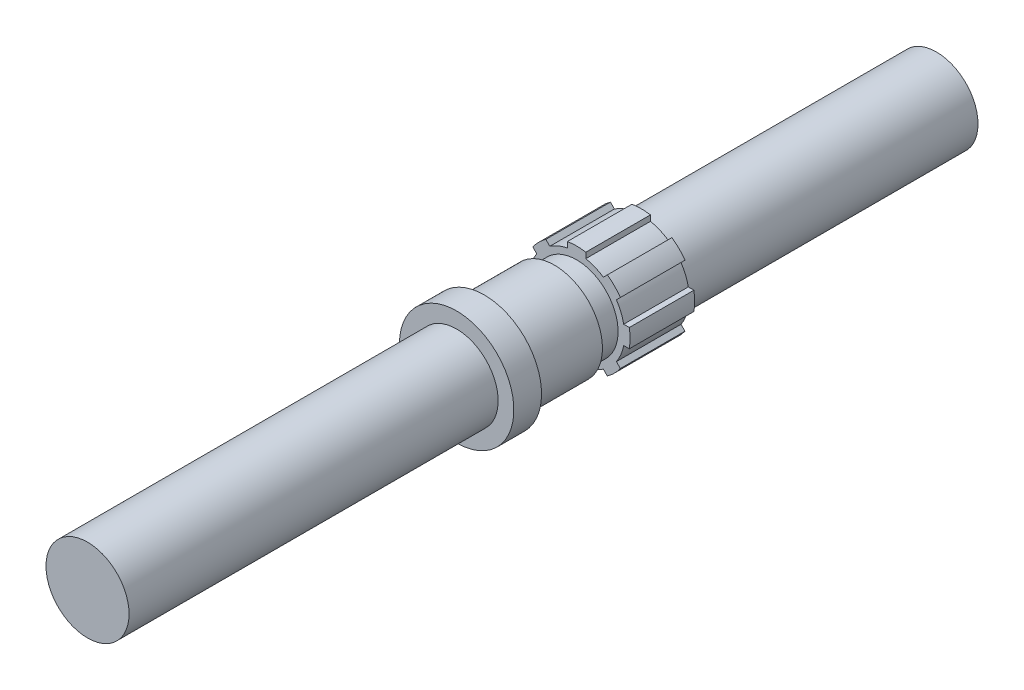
ISO-10303-21;
HEADER;
FILE_DESCRIPTION(('STEP AP214'),'2;1');
FILE_NAME('part.step','',(''),(''),'','','');
FILE_SCHEMA(('AUTOMOTIVE_DESIGN { 1 0 10303 214 1 1 1 1 }'));
ENDSEC;
DATA;
#1=APPLICATION_CONTEXT('core data for automotive mechanical design processes');
#2=APPLICATION_PROTOCOL_DEFINITION('international standard','automotive_design',2000,#1);
#3=PRODUCT_CONTEXT('',#1,'mechanical');
#4=PRODUCT('Part','Part','',(#3));
#5=PRODUCT_RELATED_PRODUCT_CATEGORY('part','',(#4));
#6=PRODUCT_DEFINITION_FORMATION('','',#4);
#7=PRODUCT_DEFINITION_CONTEXT('part definition',#1,'design');
#8=PRODUCT_DEFINITION('design','',#6,#7);
#9=PRODUCT_DEFINITION_SHAPE('','',#8);
#10=(LENGTH_UNIT() NAMED_UNIT(*) SI_UNIT(.MILLI.,.METRE.));
#11=(NAMED_UNIT(*) PLANE_ANGLE_UNIT() SI_UNIT($,.RADIAN.));
#12=(NAMED_UNIT(*) SI_UNIT($,.STERADIAN.) SOLID_ANGLE_UNIT());
#13=UNCERTAINTY_MEASURE_WITH_UNIT(LENGTH_MEASURE(1.E-05),#10,'distance_accuracy_value','');
#14=(GEOMETRIC_REPRESENTATION_CONTEXT(3) GLOBAL_UNCERTAINTY_ASSIGNED_CONTEXT((#13)) GLOBAL_UNIT_ASSIGNED_CONTEXT((#10,
#11,#12)) REPRESENTATION_CONTEXT('',''));
#15=CARTESIAN_POINT('',(0.,0.,0.));
#16=DIRECTION('',(0.,0.,1.));
#17=DIRECTION('',(1.,0.,0.));
#18=AXIS2_PLACEMENT_3D('',#15,#16,#17);
#19=CARTESIAN_POINT('',(0.,0.,245.));
#20=DIRECTION('',(0.,0.,-1.));
#21=DIRECTION('',(-1.,0.,0.));
#22=AXIS2_PLACEMENT_3D('',#19,#20,#21);
#23=CYLINDRICAL_SURFACE('',#22,26.);
#24=CARTESIAN_POINT('',(0.,0.,207.));
#25=DIRECTION('',(0.,0.,-1.));
#26=DIRECTION('',(-1.,0.,0.));
#27=AXIS2_PLACEMENT_3D('',#24,#25,#26);
#28=CIRCLE('',#27,26.);
#29=CARTESIAN_POINT('',(-26.,0.,207.));
#30=VERTEX_POINT('',#29);
#31=EDGE_CURVE('E609',#30,#30,#28,.T.);
#32=ORIENTED_EDGE('',*,*,#31,.F.);
#33=EDGE_LOOP('',(#32));
#34=FACE_BOUND('',#33,.T.);
#35=CARTESIAN_POINT('',(0.,0.,245.));
#36=DIRECTION('',(0.,0.,-1.));
#37=DIRECTION('',(-1.,0.,0.));
#38=AXIS2_PLACEMENT_3D('',#35,#36,#37);
#39=CIRCLE('',#38,26.);
#40=CARTESIAN_POINT('',(-26.,0.,245.));
#41=VERTEX_POINT('',#40);
#42=EDGE_CURVE('E621',#41,#41,#39,.F.);
#43=ORIENTED_EDGE('',*,*,#42,.F.);
#44=EDGE_LOOP('',(#43));
#45=FACE_BOUND('',#44,.T.);
#46=ADVANCED_FACE('F27',(#34,#45),#23,.T.);
#47=CARTESIAN_POINT('',(0.,0.,260.));
#48=DIRECTION('',(0.,0.,-1.));
#49=DIRECTION('',(-1.,0.,0.));
#50=AXIS2_PLACEMENT_3D('',#47,#48,#49);
#51=PLANE('',#50);
#52=CARTESIAN_POINT('',(0.,0.,260.));
#53=DIRECTION('',(0.,0.,-1.));
#54=DIRECTION('',(-1.,0.,0.));
#55=AXIS2_PLACEMENT_3D('',#52,#53,#54);
#56=CIRCLE('',#55,31.);
#57=CARTESIAN_POINT('',(-31.,0.,260.));
#58=VERTEX_POINT('',#57);
#59=EDGE_CURVE('E618',#58,#58,#56,.T.);
#60=ORIENTED_EDGE('',*,*,#59,.F.);
#61=EDGE_LOOP('',(#60));
#62=FACE_BOUND('',#61,.T.);
#63=CARTESIAN_POINT('',(0.,0.,260.));
#64=DIRECTION('',(0.,0.,-1.));
#65=DIRECTION('',(-1.,0.,0.));
#66=AXIS2_PLACEMENT_3D('',#63,#64,#65);
#67=CIRCLE('',#66,22.5);
#68=CARTESIAN_POINT('',(-22.5,0.,260.));
#69=VERTEX_POINT('',#68);
#70=EDGE_CURVE('E11',#69,#69,#67,.T.);
#71=ORIENTED_EDGE('',*,*,#70,.T.);
#72=EDGE_LOOP('',(#71));
#73=FACE_BOUND('',#72,.T.);
#74=ADVANCED_FACE('F469',(#62,#73),#51,.F.);
#75=CARTESIAN_POINT('',(0.,0.,260.));
#76=DIRECTION('',(0.,0.,-1.));
#77=DIRECTION('',(-1.,0.,0.));
#78=AXIS2_PLACEMENT_3D('',#75,#76,#77);
#79=CYLINDRICAL_SURFACE('',#78,31.);
#80=ORIENTED_EDGE('',*,*,#59,.T.);
#81=EDGE_LOOP('',(#80));
#82=FACE_BOUND('',#81,.T.);
#83=CARTESIAN_POINT('',(0.,0.,245.));
#84=DIRECTION('',(0.,0.,-1.));
#85=DIRECTION('',(-1.,0.,0.));
#86=AXIS2_PLACEMENT_3D('',#83,#84,#85);
#87=CIRCLE('',#86,31.);
#88=CARTESIAN_POINT('',(-31.,0.,245.));
#89=VERTEX_POINT('',#88);
#90=EDGE_CURVE('E615',#89,#89,#87,.T.);
#91=ORIENTED_EDGE('',*,*,#90,.F.);
#92=EDGE_LOOP('',(#91));
#93=FACE_BOUND('',#92,.T.);
#94=ADVANCED_FACE('F477',(#82,#93),#79,.T.);
#95=CARTESIAN_POINT('',(0.,0.,245.));
#96=DIRECTION('',(0.,0.,-1.));
#97=DIRECTION('',(-1.,0.,0.));
#98=AXIS2_PLACEMENT_3D('',#95,#96,#97);
#99=PLANE('',#98);
#100=ORIENTED_EDGE('',*,*,#42,.T.);
#101=EDGE_LOOP('',(#100));
#102=FACE_BOUND('',#101,.T.);
#103=ORIENTED_EDGE('',*,*,#90,.T.);
#104=EDGE_LOOP('',(#103));
#105=FACE_BOUND('',#104,.T.);
#106=ADVANCED_FACE('F669',(#102,#105),#99,.T.);
#107=CARTESIAN_POINT('',(0.,0.,460.));
#108=DIRECTION('',(0.,0.,1.));
#109=DIRECTION('',(1.,0.,0.));
#110=AXIS2_PLACEMENT_3D('',#107,#108,#109);
#111=PLANE('',#110);
#112=CARTESIAN_POINT('',(0.,0.,460.));
#113=DIRECTION('',(0.,0.,1.));
#114=DIRECTION('',(1.,0.,0.));
#115=AXIS2_PLACEMENT_3D('',#112,#113,#114);
#116=CIRCLE('',#115,22.5);
#117=CARTESIAN_POINT('',(22.5,0.,460.));
#118=VERTEX_POINT('',#117);
#119=EDGE_CURVE('E35',#118,#118,#116,.T.);
#120=ORIENTED_EDGE('',*,*,#119,.T.);
#121=EDGE_LOOP('',(#120));
#122=FACE_BOUND('',#121,.T.);
#123=ADVANCED_FACE('F665',(#122),#111,.T.);
#124=CARTESIAN_POINT('',(0.,0.,460.));
#125=DIRECTION('',(0.,0.,-1.));
#126=DIRECTION('',(-1.,0.,0.));
#127=AXIS2_PLACEMENT_3D('',#124,#125,#126);
#128=CYLINDRICAL_SURFACE('',#127,22.5);
#129=ORIENTED_EDGE('',*,*,#119,.F.);
#130=EDGE_LOOP('',(#129));
#131=FACE_BOUND('',#130,.T.);
#132=ORIENTED_EDGE('',*,*,#70,.F.);
#133=EDGE_LOOP('',(#132));
#134=FACE_BOUND('',#133,.T.);
#135=ADVANCED_FACE('F466',(#131,#134),#128,.T.);
#136=CARTESIAN_POINT('',(0.,26.,207.));
#137=DIRECTION('',(0.,0.,1.));
#138=DIRECTION('',(1.,0.,0.));
#139=AXIS2_PLACEMENT_3D('',#136,#137,#138);
#140=PLANE('',#139);
#141=CARTESIAN_POINT('',(0.,0.,207.));
#142=DIRECTION('',(0.,0.,-1.));
#143=DIRECTION('',(-1.,0.,0.));
#144=AXIS2_PLACEMENT_3D('',#141,#142,#143);
#145=CIRCLE('',#144,22.5);
#146=CARTESIAN_POINT('',(-22.5,0.,207.));
#147=VERTEX_POINT('',#146);
#148=EDGE_CURVE('E612',#147,#147,#145,.T.);
#149=ORIENTED_EDGE('',*,*,#148,.F.);
#150=EDGE_LOOP('',(#149));
#151=FACE_BOUND('',#150,.T.);
#152=ORIENTED_EDGE('',*,*,#31,.T.);
#153=EDGE_LOOP('',(#152));
#154=FACE_BOUND('',#153,.T.);
#155=ADVANCED_FACE('F656',(#151,#154),#140,.F.);
#156=CARTESIAN_POINT('',(0.,0.,0.));
#157=DIRECTION('',(0.,0.,-1.));
#158=DIRECTION('',(-1.,0.,0.));
#159=AXIS2_PLACEMENT_3D('',#156,#157,#158);
#160=CYLINDRICAL_SURFACE('',#159,22.5);
#161=CARTESIAN_POINT('',(0.,0.,195.));
#162=DIRECTION('',(0.,0.,-1.));
#163=DIRECTION('',(-1.,0.,0.));
#164=AXIS2_PLACEMENT_3D('',#161,#162,#163);
#165=CIRCLE('',#164,22.5);
#166=CARTESIAN_POINT('',(-22.5,0.,195.));
#167=VERTEX_POINT('',#166);
#168=EDGE_CURVE('E252',#167,#167,#165,.T.);
#169=ORIENTED_EDGE('',*,*,#168,.F.);
#170=EDGE_LOOP('',(#169));
#171=FACE_BOUND('',#170,.T.);
#172=ORIENTED_EDGE('',*,*,#148,.T.);
#173=EDGE_LOOP('',(#172));
#174=FACE_BOUND('',#173,.T.);
#175=ADVANCED_FACE('F657',(#171,#174),#160,.T.);
#176=CARTESIAN_POINT('',(0.,0.,0.));
#177=DIRECTION('',(0.,0.,1.));
#178=DIRECTION('',(1.,0.,0.));
#179=AXIS2_PLACEMENT_3D('',#176,#177,#178);
#180=PLANE('',#179);
#181=CARTESIAN_POINT('',(0.,0.,0.));
#182=DIRECTION('',(0.,0.,1.));
#183=DIRECTION('',(1.,0.,0.));
#184=AXIS2_PLACEMENT_3D('',#181,#182,#183);
#185=CIRCLE('',#184,22.5);
#186=CARTESIAN_POINT('',(22.5,0.,0.));
#187=VERTEX_POINT('',#186);
#188=EDGE_CURVE('E443',#187,#187,#185,.T.);
#189=ORIENTED_EDGE('',*,*,#188,.F.);
#190=EDGE_LOOP('',(#189));
#191=FACE_BOUND('',#190,.T.);
#192=ADVANCED_FACE('F465',(#191),#180,.F.);
#193=CARTESIAN_POINT('',(0.,0.,160.));
#194=DIRECTION('',(0.,0.,-1.));
#195=DIRECTION('',(-1.,0.,0.));
#196=AXIS2_PLACEMENT_3D('',#193,#194,#195);
#197=CIRCLE('',#196,22.5);
#198=CARTESIAN_POINT('',(-22.5,0.,160.));
#199=VERTEX_POINT('',#198);
#200=EDGE_CURVE('E441',#199,#199,#197,.T.);
#201=ORIENTED_EDGE('',*,*,#200,.T.);
#202=EDGE_LOOP('',(#201));
#203=FACE_BOUND('',#202,.T.);
#204=ORIENTED_EDGE('',*,*,#188,.T.);
#205=EDGE_LOOP('',(#204));
#206=FACE_BOUND('',#205,.T.);
#207=ADVANCED_FACE('F29',(#203,#206),#128,.T.);
#208=CARTESIAN_POINT('',(0.,0.,160.));
#209=DIRECTION('',(0.,0.,-1.));
#210=DIRECTION('',(-1.,0.,0.));
#211=AXIS2_PLACEMENT_3D('',#208,#209,#210);
#212=PLANE('',#211);
#213=CARTESIAN_POINT('',(0.,0.,160.));
#214=DIRECTION('',(0.,0.,-1.));
#215=DIRECTION('',(-1.,0.,0.));
#216=AXIS2_PLACEMENT_3D('',#213,#214,#215);
#217=CIRCLE('',#216,26.);
#218=CARTESIAN_POINT('',(5.,25.5147016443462,160.));
#219=VERTEX_POINT('',#218);
#220=CARTESIAN_POINT('',(14.506084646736,21.5771524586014,160.));
#221=VERTEX_POINT('',#220);
#222=EDGE_CURVE('E438',#219,#221,#217,.T.);
#223=ORIENTED_EDGE('',*,*,#222,.T.);
#224=DIRECTION('',(0.707106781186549,0.707106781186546,0.));
#225=VECTOR('',#224,1.);
#226=CARTESIAN_POINT('',(14.506084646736,21.5771524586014,160.));
#227=LINE('',#226,#225);
#228=CARTESIAN_POINT('',(16.6634759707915,23.7345437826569,160.));
#229=VERTEX_POINT('',#228);
#230=EDGE_CURVE('E377',#221,#229,#227,.T.);
#231=ORIENTED_EDGE('',*,*,#230,.T.);
#232=CARTESIAN_POINT('',(0.,0.,160.));
#233=DIRECTION('',(0.,0.,-1.));
#234=DIRECTION('',(-0.707106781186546,0.707106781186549,0.));
#235=AXIS2_PLACEMENT_3D('',#232,#233,#234);
#236=CIRCLE('',#235,29.);
#237=CARTESIAN_POINT('',(23.7345437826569,16.6634759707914,160.));
#238=VERTEX_POINT('',#237);
#239=EDGE_CURVE('E386',#229,#238,#236,.T.);
#240=ORIENTED_EDGE('',*,*,#239,.T.);
#241=DIRECTION('',(-0.707106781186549,-0.707106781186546,0.));
#242=VECTOR('',#241,1.);
#243=CARTESIAN_POINT('',(21.5771524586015,14.5060846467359,160.));
#244=LINE('',#243,#242);
#245=CARTESIAN_POINT('',(21.5771524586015,14.5060846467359,160.));
#246=VERTEX_POINT('',#245);
#247=EDGE_CURVE('E389',#238,#246,#244,.T.);
#248=ORIENTED_EDGE('',*,*,#247,.T.);
#249=CARTESIAN_POINT('',(25.5147016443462,4.99999999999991,160.));
#250=VERTEX_POINT('',#249);
#251=EDGE_CURVE('E442',#246,#250,#217,.T.);
#252=ORIENTED_EDGE('',*,*,#251,.T.);
#253=DIRECTION('',(1.,0.,0.));
#254=VECTOR('',#253,1.);
#255=CARTESIAN_POINT('',(25.5147016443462,4.99999999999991,160.));
#256=LINE('',#255,#254);
#257=CARTESIAN_POINT('',(28.5657137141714,4.9999999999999,160.));
#258=VERTEX_POINT('',#257);
#259=EDGE_CURVE('E350',#250,#258,#256,.T.);
#260=ORIENTED_EDGE('',*,*,#259,.T.);
#261=CARTESIAN_POINT('',(0.,0.,160.));
#262=DIRECTION('',(0.,0.,-1.));
#263=DIRECTION('',(0.,1.,0.));
#264=AXIS2_PLACEMENT_3D('',#261,#262,#263);
#265=CIRCLE('',#264,29.);
#266=CARTESIAN_POINT('',(28.5657137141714,-5.0000000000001,160.));
#267=VERTEX_POINT('',#266);
#268=EDGE_CURVE('E359',#258,#267,#265,.T.);
#269=ORIENTED_EDGE('',*,*,#268,.T.);
#270=DIRECTION('',(-1.,0.,0.));
#271=VECTOR('',#270,1.);
#272=CARTESIAN_POINT('',(25.5147016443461,-5.00000000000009,160.));
#273=LINE('',#272,#271);
#274=CARTESIAN_POINT('',(25.5147016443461,-5.00000000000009,160.));
#275=VERTEX_POINT('',#274);
#276=EDGE_CURVE('E362',#267,#275,#273,.T.);
#277=ORIENTED_EDGE('',*,*,#276,.T.);
#278=CARTESIAN_POINT('',(21.5771524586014,-14.5060846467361,160.));
#279=VERTEX_POINT('',#278);
#280=EDGE_CURVE('E592',#275,#279,#217,.T.);
#281=ORIENTED_EDGE('',*,*,#280,.T.);
#282=DIRECTION('',(0.707106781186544,-0.707106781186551,0.));
#283=VECTOR('',#282,1.);
#284=CARTESIAN_POINT('',(21.5771524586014,-14.5060846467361,160.));
#285=LINE('',#284,#283);
#286=CARTESIAN_POINT('',(23.7345437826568,-16.6634759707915,160.));
#287=VERTEX_POINT('',#286);
#288=EDGE_CURVE('E323',#279,#287,#285,.T.);
#289=ORIENTED_EDGE('',*,*,#288,.T.);
#290=CARTESIAN_POINT('',(0.,0.,160.));
#291=DIRECTION('',(0.,0.,-1.));
#292=DIRECTION('',(0.707106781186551,0.707106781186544,0.));
#293=AXIS2_PLACEMENT_3D('',#290,#291,#292);
#294=CIRCLE('',#293,29.);
#295=CARTESIAN_POINT('',(16.6634759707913,-23.734543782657,160.));
#296=VERTEX_POINT('',#295);
#297=EDGE_CURVE('E332',#287,#296,#294,.T.);
#298=ORIENTED_EDGE('',*,*,#297,.T.);
#299=DIRECTION('',(-0.707106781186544,0.707106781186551,0.));
#300=VECTOR('',#299,1.);
#301=CARTESIAN_POINT('',(14.5060846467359,-21.5771524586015,160.));
#302=LINE('',#301,#300);
#303=CARTESIAN_POINT('',(14.5060846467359,-21.5771524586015,160.));
#304=VERTEX_POINT('',#303);
#305=EDGE_CURVE('E335',#296,#304,#302,.T.);
#306=ORIENTED_EDGE('',*,*,#305,.T.);
#307=CARTESIAN_POINT('',(4.99999999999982,-25.5147016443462,160.));
#308=VERTEX_POINT('',#307);
#309=EDGE_CURVE('E589',#304,#308,#217,.T.);
#310=ORIENTED_EDGE('',*,*,#309,.T.);
#311=DIRECTION('',(0.,-1.,0.));
#312=VECTOR('',#311,1.);
#313=CARTESIAN_POINT('',(4.99999999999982,-25.5147016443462,160.));
#314=LINE('',#313,#312);
#315=CARTESIAN_POINT('',(4.9999999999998,-28.5657137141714,160.));
#316=VERTEX_POINT('',#315);
#317=EDGE_CURVE('E296',#308,#316,#314,.T.);
#318=ORIENTED_EDGE('',*,*,#317,.T.);
#319=CARTESIAN_POINT('',(0.,0.,160.));
#320=DIRECTION('',(0.,0.,-1.));
#321=DIRECTION('',(1.,0.,0.));
#322=AXIS2_PLACEMENT_3D('',#319,#320,#321);
#323=CIRCLE('',#322,29.);
#324=CARTESIAN_POINT('',(-5.0000000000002,-28.5657137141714,160.));
#325=VERTEX_POINT('',#324);
#326=EDGE_CURVE('E305',#316,#325,#323,.T.);
#327=ORIENTED_EDGE('',*,*,#326,.T.);
#328=DIRECTION('',(0.,1.,0.));
#329=VECTOR('',#328,1.);
#330=CARTESIAN_POINT('',(-5.00000000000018,-25.5147016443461,160.));
#331=LINE('',#330,#329);
#332=CARTESIAN_POINT('',(-5.00000000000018,-25.5147016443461,160.));
#333=VERTEX_POINT('',#332);
#334=EDGE_CURVE('E308',#325,#333,#331,.T.);
#335=ORIENTED_EDGE('',*,*,#334,.T.);
#336=CARTESIAN_POINT('',(-14.5060846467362,-21.5771524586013,160.));
#337=VERTEX_POINT('',#336);
#338=EDGE_CURVE('E587',#333,#337,#217,.T.);
#339=ORIENTED_EDGE('',*,*,#338,.T.);
#340=DIRECTION('',(-0.707106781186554,-0.707106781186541,0.));
#341=VECTOR('',#340,1.);
#342=CARTESIAN_POINT('',(-14.5060846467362,-21.5771524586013,160.));
#343=LINE('',#342,#341);
#344=CARTESIAN_POINT('',(-16.6634759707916,-23.7345437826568,160.));
#345=VERTEX_POINT('',#344);
#346=EDGE_CURVE('E267',#337,#345,#343,.T.);
#347=ORIENTED_EDGE('',*,*,#346,.T.);
#348=CARTESIAN_POINT('',(0.,0.,160.));
#349=DIRECTION('',(0.,0.,-1.));
#350=DIRECTION('',(0.707106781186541,-0.707106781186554,0.));
#351=AXIS2_PLACEMENT_3D('',#348,#349,#350);
#352=CIRCLE('',#351,29.);
#353=CARTESIAN_POINT('',(-23.734543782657,-16.6634759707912,160.));
#354=VERTEX_POINT('',#353);
#355=EDGE_CURVE('E270',#345,#354,#352,.T.);
#356=ORIENTED_EDGE('',*,*,#355,.T.);
#357=DIRECTION('',(0.707106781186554,0.707106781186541,0.));
#358=VECTOR('',#357,1.);
#359=CARTESIAN_POINT('',(-21.5771524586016,-14.5060846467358,160.));
#360=LINE('',#359,#358);
#361=CARTESIAN_POINT('',(-21.5771524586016,-14.5060846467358,160.));
#362=VERTEX_POINT('',#361);
#363=EDGE_CURVE('E281',#354,#362,#360,.T.);
#364=ORIENTED_EDGE('',*,*,#363,.T.);
#365=CARTESIAN_POINT('',(-25.5147016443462,-4.99999999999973,160.));
#366=VERTEX_POINT('',#365);
#367=EDGE_CURVE('E590',#362,#366,#217,.T.);
#368=ORIENTED_EDGE('',*,*,#367,.T.);
#369=DIRECTION('',(-1.,0.,0.));
#370=VECTOR('',#369,1.);
#371=CARTESIAN_POINT('',(-25.5147016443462,-4.99999999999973,160.));
#372=LINE('',#371,#370);
#373=CARTESIAN_POINT('',(-28.5657137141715,-4.9999999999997,160.));
#374=VERTEX_POINT('',#373);
#375=EDGE_CURVE('E637',#366,#374,#372,.T.);
#376=ORIENTED_EDGE('',*,*,#375,.T.);
#377=CARTESIAN_POINT('',(0.,0.,160.));
#378=DIRECTION('',(0.,0.,-1.));
#379=DIRECTION('',(0.,-1.,0.));
#380=AXIS2_PLACEMENT_3D('',#377,#378,#379);
#381=CIRCLE('',#380,29.);
#382=CARTESIAN_POINT('',(-28.5657137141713,5.0000000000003,160.));
#383=VERTEX_POINT('',#382);
#384=EDGE_CURVE('E644',#374,#383,#381,.T.);
#385=ORIENTED_EDGE('',*,*,#384,.T.);
#386=DIRECTION('',(1.,0.,0.));
#387=VECTOR('',#386,1.);
#388=CARTESIAN_POINT('',(-25.5147016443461,5.00000000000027,160.));
#389=LINE('',#388,#387);
#390=CARTESIAN_POINT('',(-25.5147016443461,5.00000000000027,160.));
#391=VERTEX_POINT('',#390);
#392=EDGE_CURVE('E49',#383,#391,#389,.T.);
#393=ORIENTED_EDGE('',*,*,#392,.T.);
#394=CARTESIAN_POINT('',(-21.5771524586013,14.5060846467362,160.));
#395=VERTEX_POINT('',#394);
#396=EDGE_CURVE('E266',#391,#395,#217,.T.);
#397=ORIENTED_EDGE('',*,*,#396,.T.);
#398=DIRECTION('',(-0.707106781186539,0.707106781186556,0.));
#399=VECTOR('',#398,1.);
#400=CARTESIAN_POINT('',(-21.5771524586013,14.5060846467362,160.));
#401=LINE('',#400,#399);
#402=CARTESIAN_POINT('',(-23.7345437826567,16.6634759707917,160.));
#403=VERTEX_POINT('',#402);
#404=EDGE_CURVE('E624',#395,#403,#401,.T.);
#405=ORIENTED_EDGE('',*,*,#404,.T.);
#406=CARTESIAN_POINT('',(0.,0.,160.));
#407=DIRECTION('',(0.,0.,-1.));
#408=DIRECTION('',(-0.707106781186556,-0.707106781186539,0.));
#409=AXIS2_PLACEMENT_3D('',#406,#407,#408);
#410=CIRCLE('',#409,29.);
#411=CARTESIAN_POINT('',(-16.6634759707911,23.7345437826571,160.));
#412=VERTEX_POINT('',#411);
#413=EDGE_CURVE('E626',#403,#412,#410,.T.);
#414=ORIENTED_EDGE('',*,*,#413,.T.);
#415=DIRECTION('',(0.707106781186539,-0.707106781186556,0.));
#416=VECTOR('',#415,1.);
#417=CARTESIAN_POINT('',(-14.5060846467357,21.5771524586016,160.));
#418=LINE('',#417,#416);
#419=CARTESIAN_POINT('',(-14.5060846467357,21.5771524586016,160.));
#420=VERTEX_POINT('',#419);
#421=EDGE_CURVE('E42',#412,#420,#418,.T.);
#422=ORIENTED_EDGE('',*,*,#421,.T.);
#423=CARTESIAN_POINT('',(-5.,25.5147016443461,160.));
#424=VERTEX_POINT('',#423);
#425=EDGE_CURVE('E431',#420,#424,#217,.T.);
#426=ORIENTED_EDGE('',*,*,#425,.T.);
#427=DIRECTION('',(0.,1.,0.));
#428=VECTOR('',#427,1.);
#429=CARTESIAN_POINT('',(-5.,25.5147016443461,160.));
#430=LINE('',#429,#428);
#431=CARTESIAN_POINT('',(-5.,28.5657137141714,160.));
#432=VERTEX_POINT('',#431);
#433=EDGE_CURVE('E404',#424,#432,#430,.T.);
#434=ORIENTED_EDGE('',*,*,#433,.T.);
#435=CARTESIAN_POINT('',(0.,0.,160.));
#436=DIRECTION('',(0.,0.,-1.));
#437=DIRECTION('',(-1.,0.,0.));
#438=AXIS2_PLACEMENT_3D('',#435,#436,#437);
#439=CIRCLE('',#438,29.);
#440=CARTESIAN_POINT('',(5.,28.5657137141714,160.));
#441=VERTEX_POINT('',#440);
#442=EDGE_CURVE('E413',#432,#441,#439,.T.);
#443=ORIENTED_EDGE('',*,*,#442,.T.);
#444=DIRECTION('',(0.,-1.,0.));
#445=VECTOR('',#444,1.);
#446=CARTESIAN_POINT('',(5.,25.5147016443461,160.));
#447=LINE('',#446,#445);
#448=EDGE_CURVE('E416',#441,#219,#447,.T.);
#449=ORIENTED_EDGE('',*,*,#448,.T.);
#450=EDGE_LOOP('',(#223,#231,#240,#248,#252,#260,#269,#277,#281,#289,#298,#306,#310,#318,#327,
#335,#339,#347,#356,#364,#368,#376,#385,#393,#397,#405,#414,#422,#426,#434,#443,#449));
#451=FACE_BOUND('',#450,.T.);
#452=ORIENTED_EDGE('',*,*,#200,.F.);
#453=EDGE_LOOP('',(#452));
#454=FACE_BOUND('',#453,.T.);
#455=ADVANCED_FACE('F452',(#451,#454),#212,.T.);
#456=CARTESIAN_POINT('',(-5.,25.5147016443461,195.));
#457=DIRECTION('',(-1.,0.,0.));
#458=DIRECTION('',(0.,0.,1.));
#459=AXIS2_PLACEMENT_3D('',#456,#457,#458);
#460=PLANE('',#459);
#461=ORIENTED_EDGE('',*,*,#433,.F.);
#462=DIRECTION('',(0.,0.,-1.));
#463=VECTOR('',#462,1.);
#464=CARTESIAN_POINT('',(-5.,25.5147016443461,195.));
#465=LINE('',#464,#463);
#466=CARTESIAN_POINT('',(-5.,25.5147016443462,195.));
#467=VERTEX_POINT('',#466);
#468=EDGE_CURVE('E427',#467,#424,#465,.T.);
#469=ORIENTED_EDGE('',*,*,#468,.F.);
#470=DIRECTION('',(0.,1.,0.));
#471=VECTOR('',#470,1.);
#472=CARTESIAN_POINT('',(-5.,25.5147016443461,195.));
#473=LINE('',#472,#471);
#474=CARTESIAN_POINT('',(-5.,28.5657137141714,195.));
#475=VERTEX_POINT('',#474);
#476=EDGE_CURVE('E418',#467,#475,#473,.T.);
#477=ORIENTED_EDGE('',*,*,#476,.T.);
#478=DIRECTION('',(0.,0.,-1.));
#479=VECTOR('',#478,1.);
#480=CARTESIAN_POINT('',(-5.,28.5657137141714,195.));
#481=LINE('',#480,#479);
#482=EDGE_CURVE('E434',#475,#432,#481,.T.);
#483=ORIENTED_EDGE('',*,*,#482,.T.);
#484=EDGE_LOOP('',(#461,#469,#477,#483));
#485=FACE_BOUND('',#484,.T.);
#486=ADVANCED_FACE('F454',(#485),#460,.T.);
#487=CARTESIAN_POINT('',(0.,0.,195.));
#488=DIRECTION('',(0.,0.,-1.));
#489=DIRECTION('',(-1.,0.,0.));
#490=AXIS2_PLACEMENT_3D('',#487,#488,#489);
#491=CYLINDRICAL_SURFACE('',#490,29.);
#492=ORIENTED_EDGE('',*,*,#442,.F.);
#493=ORIENTED_EDGE('',*,*,#482,.F.);
#494=CARTESIAN_POINT('',(0.,0.,195.));
#495=DIRECTION('',(0.,0.,-1.));
#496=DIRECTION('',(-1.,0.,0.));
#497=AXIS2_PLACEMENT_3D('',#494,#495,#496);
#498=CIRCLE('',#497,29.);
#499=CARTESIAN_POINT('',(5.,28.5657137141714,195.));
#500=VERTEX_POINT('',#499);
#501=EDGE_CURVE('E421',#475,#500,#498,.T.);
#502=ORIENTED_EDGE('',*,*,#501,.T.);
#503=DIRECTION('',(0.,0.,-1.));
#504=VECTOR('',#503,1.);
#505=CARTESIAN_POINT('',(5.,28.5657137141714,195.));
#506=LINE('',#505,#504);
#507=EDGE_CURVE('E432',#500,#441,#506,.T.);
#508=ORIENTED_EDGE('',*,*,#507,.T.);
#509=EDGE_LOOP('',(#492,#493,#502,#508));
#510=FACE_BOUND('',#509,.T.);
#511=ADVANCED_FACE('F461',(#510),#491,.T.);
#512=CARTESIAN_POINT('',(0.,0.,195.));
#513=DIRECTION('',(0.,0.,-1.));
#514=DIRECTION('',(-1.,0.,0.));
#515=AXIS2_PLACEMENT_3D('',#512,#513,#514);
#516=CIRCLE('',#515,26.);
#517=CARTESIAN_POINT('',(5.,25.5147016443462,195.));
#518=VERTEX_POINT('',#517);
#519=CARTESIAN_POINT('',(14.506084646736,21.5771524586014,195.));
#520=VERTEX_POINT('',#519);
#521=EDGE_CURVE('E605',#518,#520,#516,.T.);
#522=ORIENTED_EDGE('',*,*,#521,.T.);
#523=DIRECTION('',(0.,0.,-1.));
#524=VECTOR('',#523,1.);
#525=CARTESIAN_POINT('',(14.506084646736,21.5771524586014,195.));
#526=LINE('',#525,#524);
#527=EDGE_CURVE('E400',#520,#221,#526,.T.);
#528=ORIENTED_EDGE('',*,*,#527,.T.);
#529=ORIENTED_EDGE('',*,*,#222,.F.);
#530=DIRECTION('',(0.,0.,-1.));
#531=VECTOR('',#530,1.);
#532=CARTESIAN_POINT('',(5.,25.5147016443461,195.));
#533=LINE('',#532,#531);
#534=EDGE_CURVE('E428',#518,#219,#533,.T.);
#535=ORIENTED_EDGE('',*,*,#534,.F.);
#536=EDGE_LOOP('',(#522,#528,#529,#535));
#537=FACE_BOUND('',#536,.T.);
#538=ADVANCED_FACE('F505',(#537),#23,.T.);
#539=CARTESIAN_POINT('',(14.506084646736,21.5771524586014,195.));
#540=DIRECTION('',(-0.707106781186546,0.707106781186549,0.));
#541=DIRECTION('',(-0.707106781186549,-0.707106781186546,0.));
#542=AXIS2_PLACEMENT_3D('',#539,#540,#541);
#543=PLANE('',#542);
#544=ORIENTED_EDGE('',*,*,#230,.F.);
#545=ORIENTED_EDGE('',*,*,#527,.F.);
#546=DIRECTION('',(0.707106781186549,0.707106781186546,0.));
#547=VECTOR('',#546,1.);
#548=CARTESIAN_POINT('',(14.506084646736,21.5771524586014,195.));
#549=LINE('',#548,#547);
#550=CARTESIAN_POINT('',(16.6634759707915,23.7345437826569,195.));
#551=VERTEX_POINT('',#550);
#552=EDGE_CURVE('E391',#520,#551,#549,.T.);
#553=ORIENTED_EDGE('',*,*,#552,.T.);
#554=DIRECTION('',(0.,0.,-1.));
#555=VECTOR('',#554,1.);
#556=CARTESIAN_POINT('',(16.6634759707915,23.7345437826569,195.));
#557=LINE('',#556,#555);
#558=EDGE_CURVE('E407',#551,#229,#557,.T.);
#559=ORIENTED_EDGE('',*,*,#558,.T.);
#560=EDGE_LOOP('',(#544,#545,#553,#559));
#561=FACE_BOUND('',#560,.T.);
#562=ADVANCED_FACE('F515',(#561),#543,.T.);
#563=CARTESIAN_POINT('',(0.,0.,195.));
#564=DIRECTION('',(0.,0.,-1.));
#565=DIRECTION('',(-1.,0.,0.));
#566=AXIS2_PLACEMENT_3D('',#563,#564,#565);
#567=CYLINDRICAL_SURFACE('',#566,29.);
#568=ORIENTED_EDGE('',*,*,#239,.F.);
#569=ORIENTED_EDGE('',*,*,#558,.F.);
#570=CARTESIAN_POINT('',(0.,0.,195.));
#571=DIRECTION('',(0.,0.,-1.));
#572=DIRECTION('',(-0.707106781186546,0.707106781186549,0.));
#573=AXIS2_PLACEMENT_3D('',#570,#571,#572);
#574=CIRCLE('',#573,29.);
#575=CARTESIAN_POINT('',(23.7345437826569,16.6634759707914,195.));
#576=VERTEX_POINT('',#575);
#577=EDGE_CURVE('E394',#551,#576,#574,.T.);
#578=ORIENTED_EDGE('',*,*,#577,.T.);
#579=DIRECTION('',(0.,0.,-1.));
#580=VECTOR('',#579,1.);
#581=CARTESIAN_POINT('',(23.7345437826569,16.6634759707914,195.));
#582=LINE('',#581,#580);
#583=EDGE_CURVE('E405',#576,#238,#582,.T.);
#584=ORIENTED_EDGE('',*,*,#583,.T.);
#585=EDGE_LOOP('',(#568,#569,#578,#584));
#586=FACE_BOUND('',#585,.T.);
#587=ADVANCED_FACE('F521',(#586),#567,.T.);
#588=CARTESIAN_POINT('',(21.5771524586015,14.5060846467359,195.));
#589=VERTEX_POINT('',#588);
#590=CARTESIAN_POINT('',(25.5147016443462,4.99999999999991,195.));
#591=VERTEX_POINT('',#590);
#592=EDGE_CURVE('E606',#589,#591,#516,.T.);
#593=ORIENTED_EDGE('',*,*,#592,.T.);
#594=DIRECTION('',(0.,0.,-1.));
#595=VECTOR('',#594,1.);
#596=CARTESIAN_POINT('',(25.5147016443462,4.99999999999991,195.));
#597=LINE('',#596,#595);
#598=EDGE_CURVE('E373',#591,#250,#597,.T.);
#599=ORIENTED_EDGE('',*,*,#598,.T.);
#600=ORIENTED_EDGE('',*,*,#251,.F.);
#601=DIRECTION('',(0.,0.,-1.));
#602=VECTOR('',#601,1.);
#603=CARTESIAN_POINT('',(21.5771524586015,14.5060846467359,195.));
#604=LINE('',#603,#602);
#605=EDGE_CURVE('E401',#589,#246,#604,.T.);
#606=ORIENTED_EDGE('',*,*,#605,.F.);
#607=EDGE_LOOP('',(#593,#599,#600,#606));
#608=FACE_BOUND('',#607,.T.);
#609=ADVANCED_FACE('F517',(#608),#23,.T.);
#610=CARTESIAN_POINT('',(25.5147016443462,4.99999999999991,195.));
#611=DIRECTION('',(0.,1.,0.));
#612=DIRECTION('',(-1.,0.,0.));
#613=AXIS2_PLACEMENT_3D('',#610,#611,#612);
#614=PLANE('',#613);
#615=ORIENTED_EDGE('',*,*,#259,.F.);
#616=ORIENTED_EDGE('',*,*,#598,.F.);
#617=DIRECTION('',(1.,0.,0.));
#618=VECTOR('',#617,1.);
#619=CARTESIAN_POINT('',(25.5147016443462,4.99999999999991,195.));
#620=LINE('',#619,#618);
#621=CARTESIAN_POINT('',(28.5657137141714,4.9999999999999,195.));
#622=VERTEX_POINT('',#621);
#623=EDGE_CURVE('E364',#591,#622,#620,.T.);
#624=ORIENTED_EDGE('',*,*,#623,.T.);
#625=DIRECTION('',(0.,0.,-1.));
#626=VECTOR('',#625,1.);
#627=CARTESIAN_POINT('',(28.5657137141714,4.9999999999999,195.));
#628=LINE('',#627,#626);
#629=EDGE_CURVE('E380',#622,#258,#628,.T.);
#630=ORIENTED_EDGE('',*,*,#629,.T.);
#631=EDGE_LOOP('',(#615,#616,#624,#630));
#632=FACE_BOUND('',#631,.T.);
#633=ADVANCED_FACE('F527',(#632),#614,.T.);
#634=CARTESIAN_POINT('',(0.,0.,195.));
#635=DIRECTION('',(0.,0.,-1.));
#636=DIRECTION('',(-1.,0.,0.));
#637=AXIS2_PLACEMENT_3D('',#634,#635,#636);
#638=CYLINDRICAL_SURFACE('',#637,29.);
#639=ORIENTED_EDGE('',*,*,#268,.F.);
#640=ORIENTED_EDGE('',*,*,#629,.F.);
#641=CARTESIAN_POINT('',(0.,0.,195.));
#642=DIRECTION('',(0.,0.,-1.));
#643=DIRECTION('',(0.,1.,0.));
#644=AXIS2_PLACEMENT_3D('',#641,#642,#643);
#645=CIRCLE('',#644,29.);
#646=CARTESIAN_POINT('',(28.5657137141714,-5.0000000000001,195.));
#647=VERTEX_POINT('',#646);
#648=EDGE_CURVE('E367',#622,#647,#645,.T.);
#649=ORIENTED_EDGE('',*,*,#648,.T.);
#650=DIRECTION('',(0.,0.,-1.));
#651=VECTOR('',#650,1.);
#652=CARTESIAN_POINT('',(28.5657137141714,-5.0000000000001,195.));
#653=LINE('',#652,#651);
#654=EDGE_CURVE('E378',#647,#267,#653,.T.);
#655=ORIENTED_EDGE('',*,*,#654,.T.);
#656=EDGE_LOOP('',(#639,#640,#649,#655));
#657=FACE_BOUND('',#656,.T.);
#658=ADVANCED_FACE('F533',(#657),#638,.T.);
#659=CARTESIAN_POINT('',(25.5147016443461,-5.00000000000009,195.));
#660=VERTEX_POINT('',#659);
#661=CARTESIAN_POINT('',(21.5771524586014,-14.5060846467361,195.));
#662=VERTEX_POINT('',#661);
#663=EDGE_CURVE('E728',#660,#662,#516,.T.);
#664=ORIENTED_EDGE('',*,*,#663,.T.);
#665=DIRECTION('',(0.,0.,-1.));
#666=VECTOR('',#665,1.);
#667=CARTESIAN_POINT('',(21.5771524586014,-14.5060846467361,195.));
#668=LINE('',#667,#666);
#669=EDGE_CURVE('E346',#662,#279,#668,.T.);
#670=ORIENTED_EDGE('',*,*,#669,.T.);
#671=ORIENTED_EDGE('',*,*,#280,.F.);
#672=DIRECTION('',(0.,0.,-1.));
#673=VECTOR('',#672,1.);
#674=CARTESIAN_POINT('',(25.5147016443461,-5.00000000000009,195.));
#675=LINE('',#674,#673);
#676=EDGE_CURVE('E374',#660,#275,#675,.T.);
#677=ORIENTED_EDGE('',*,*,#676,.F.);
#678=EDGE_LOOP('',(#664,#670,#671,#677));
#679=FACE_BOUND('',#678,.T.);
#680=ADVANCED_FACE('F529',(#679),#23,.T.);
#681=CARTESIAN_POINT('',(21.5771524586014,-14.5060846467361,195.));
#682=DIRECTION('',(0.707106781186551,0.707106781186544,0.));
#683=DIRECTION('',(-0.707106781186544,0.707106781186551,0.));
#684=AXIS2_PLACEMENT_3D('',#681,#682,#683);
#685=PLANE('',#684);
#686=ORIENTED_EDGE('',*,*,#288,.F.);
#687=ORIENTED_EDGE('',*,*,#669,.F.);
#688=DIRECTION('',(0.707106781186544,-0.707106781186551,0.));
#689=VECTOR('',#688,1.);
#690=CARTESIAN_POINT('',(21.5771524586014,-14.5060846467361,195.));
#691=LINE('',#690,#689);
#692=CARTESIAN_POINT('',(23.7345437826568,-16.6634759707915,195.));
#693=VERTEX_POINT('',#692);
#694=EDGE_CURVE('E337',#662,#693,#691,.T.);
#695=ORIENTED_EDGE('',*,*,#694,.T.);
#696=DIRECTION('',(0.,0.,-1.));
#697=VECTOR('',#696,1.);
#698=CARTESIAN_POINT('',(23.7345437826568,-16.6634759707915,195.));
#699=LINE('',#698,#697);
#700=EDGE_CURVE('E353',#693,#287,#699,.T.);
#701=ORIENTED_EDGE('',*,*,#700,.T.);
#702=EDGE_LOOP('',(#686,#687,#695,#701));
#703=FACE_BOUND('',#702,.T.);
#704=ADVANCED_FACE('F539',(#703),#685,.T.);
#705=CARTESIAN_POINT('',(0.,0.,195.));
#706=DIRECTION('',(0.,0.,-1.));
#707=DIRECTION('',(-1.,0.,0.));
#708=AXIS2_PLACEMENT_3D('',#705,#706,#707);
#709=CYLINDRICAL_SURFACE('',#708,29.);
#710=ORIENTED_EDGE('',*,*,#297,.F.);
#711=ORIENTED_EDGE('',*,*,#700,.F.);
#712=CARTESIAN_POINT('',(0.,0.,195.));
#713=DIRECTION('',(0.,0.,-1.));
#714=DIRECTION('',(0.707106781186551,0.707106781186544,0.));
#715=AXIS2_PLACEMENT_3D('',#712,#713,#714);
#716=CIRCLE('',#715,29.);
#717=CARTESIAN_POINT('',(16.6634759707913,-23.734543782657,195.));
#718=VERTEX_POINT('',#717);
#719=EDGE_CURVE('E340',#693,#718,#716,.T.);
#720=ORIENTED_EDGE('',*,*,#719,.T.);
#721=DIRECTION('',(0.,0.,-1.));
#722=VECTOR('',#721,1.);
#723=CARTESIAN_POINT('',(16.6634759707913,-23.734543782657,195.));
#724=LINE('',#723,#722);
#725=EDGE_CURVE('E351',#718,#296,#724,.T.);
#726=ORIENTED_EDGE('',*,*,#725,.T.);
#727=EDGE_LOOP('',(#710,#711,#720,#726));
#728=FACE_BOUND('',#727,.T.);
#729=ADVANCED_FACE('F545',(#728),#709,.T.);
#730=CARTESIAN_POINT('',(14.5060846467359,-21.5771524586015,195.));
#731=VERTEX_POINT('',#730);
#732=CARTESIAN_POINT('',(4.99999999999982,-25.5147016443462,195.));
#733=VERTEX_POINT('',#732);
#734=EDGE_CURVE('E581',#731,#733,#516,.T.);
#735=ORIENTED_EDGE('',*,*,#734,.T.);
#736=DIRECTION('',(0.,0.,-1.));
#737=VECTOR('',#736,1.);
#738=CARTESIAN_POINT('',(4.99999999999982,-25.5147016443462,195.));
#739=LINE('',#738,#737);
#740=EDGE_CURVE('E319',#733,#308,#739,.T.);
#741=ORIENTED_EDGE('',*,*,#740,.T.);
#742=ORIENTED_EDGE('',*,*,#309,.F.);
#743=DIRECTION('',(0.,0.,-1.));
#744=VECTOR('',#743,1.);
#745=CARTESIAN_POINT('',(14.5060846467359,-21.5771524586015,195.));
#746=LINE('',#745,#744);
#747=EDGE_CURVE('E347',#731,#304,#746,.T.);
#748=ORIENTED_EDGE('',*,*,#747,.F.);
#749=EDGE_LOOP('',(#735,#741,#742,#748));
#750=FACE_BOUND('',#749,.T.);
#751=ADVANCED_FACE('F541',(#750),#23,.T.);
#752=CARTESIAN_POINT('',(4.99999999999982,-25.5147016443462,195.));
#753=DIRECTION('',(1.,0.,0.));
#754=DIRECTION('',(0.,1.,0.));
#755=AXIS2_PLACEMENT_3D('',#752,#753,#754);
#756=PLANE('',#755);
#757=ORIENTED_EDGE('',*,*,#317,.F.);
#758=ORIENTED_EDGE('',*,*,#740,.F.);
#759=DIRECTION('',(0.,-1.,0.));
#760=VECTOR('',#759,1.);
#761=CARTESIAN_POINT('',(4.99999999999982,-25.5147016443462,195.));
#762=LINE('',#761,#760);
#763=CARTESIAN_POINT('',(4.9999999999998,-28.5657137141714,195.));
#764=VERTEX_POINT('',#763);
#765=EDGE_CURVE('E310',#733,#764,#762,.T.);
#766=ORIENTED_EDGE('',*,*,#765,.T.);
#767=DIRECTION('',(0.,0.,-1.));
#768=VECTOR('',#767,1.);
#769=CARTESIAN_POINT('',(4.9999999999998,-28.5657137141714,195.));
#770=LINE('',#769,#768);
#771=EDGE_CURVE('E326',#764,#316,#770,.T.);
#772=ORIENTED_EDGE('',*,*,#771,.T.);
#773=EDGE_LOOP('',(#757,#758,#766,#772));
#774=FACE_BOUND('',#773,.T.);
#775=ADVANCED_FACE('F552',(#774),#756,.T.);
#776=CARTESIAN_POINT('',(0.,0.,195.));
#777=DIRECTION('',(0.,0.,-1.));
#778=DIRECTION('',(-1.,0.,0.));
#779=AXIS2_PLACEMENT_3D('',#776,#777,#778);
#780=CYLINDRICAL_SURFACE('',#779,29.);
#781=ORIENTED_EDGE('',*,*,#326,.F.);
#782=ORIENTED_EDGE('',*,*,#771,.F.);
#783=CARTESIAN_POINT('',(0.,0.,195.));
#784=DIRECTION('',(0.,0.,-1.));
#785=DIRECTION('',(1.,0.,0.));
#786=AXIS2_PLACEMENT_3D('',#783,#784,#785);
#787=CIRCLE('',#786,29.);
#788=CARTESIAN_POINT('',(-5.0000000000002,-28.5657137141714,195.));
#789=VERTEX_POINT('',#788);
#790=EDGE_CURVE('E313',#764,#789,#787,.T.);
#791=ORIENTED_EDGE('',*,*,#790,.T.);
#792=DIRECTION('',(0.,0.,-1.));
#793=VECTOR('',#792,1.);
#794=CARTESIAN_POINT('',(-5.0000000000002,-28.5657137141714,195.));
#795=LINE('',#794,#793);
#796=EDGE_CURVE('E324',#789,#325,#795,.T.);
#797=ORIENTED_EDGE('',*,*,#796,.T.);
#798=EDGE_LOOP('',(#781,#782,#791,#797));
#799=FACE_BOUND('',#798,.T.);
#800=ADVANCED_FACE('F557',(#799),#780,.T.);
#801=CARTESIAN_POINT('',(-5.00000000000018,-25.5147016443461,195.));
#802=VERTEX_POINT('',#801);
#803=CARTESIAN_POINT('',(-14.5060846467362,-21.5771524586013,195.));
#804=VERTEX_POINT('',#803);
#805=EDGE_CURVE('E575',#802,#804,#516,.T.);
#806=ORIENTED_EDGE('',*,*,#805,.T.);
#807=DIRECTION('',(0.,0.,-1.));
#808=VECTOR('',#807,1.);
#809=CARTESIAN_POINT('',(-14.5060846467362,-21.5771524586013,195.));
#810=LINE('',#809,#808);
#811=EDGE_CURVE('E292',#804,#337,#810,.T.);
#812=ORIENTED_EDGE('',*,*,#811,.T.);
#813=ORIENTED_EDGE('',*,*,#338,.F.);
#814=DIRECTION('',(0.,0.,-1.));
#815=VECTOR('',#814,1.);
#816=CARTESIAN_POINT('',(-5.00000000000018,-25.5147016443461,195.));
#817=LINE('',#816,#815);
#818=EDGE_CURVE('E320',#802,#333,#817,.T.);
#819=ORIENTED_EDGE('',*,*,#818,.F.);
#820=EDGE_LOOP('',(#806,#812,#813,#819));
#821=FACE_BOUND('',#820,.T.);
#822=ADVANCED_FACE('F487',(#821),#23,.T.);
#823=CARTESIAN_POINT('',(-14.5060846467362,-21.5771524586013,195.));
#824=DIRECTION('',(0.707106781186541,-0.707106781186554,0.));
#825=DIRECTION('',(0.707106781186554,0.707106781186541,0.));
#826=AXIS2_PLACEMENT_3D('',#823,#824,#825);
#827=PLANE('',#826);
#828=ORIENTED_EDGE('',*,*,#346,.F.);
#829=ORIENTED_EDGE('',*,*,#811,.F.);
#830=DIRECTION('',(-0.707106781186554,-0.707106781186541,0.));
#831=VECTOR('',#830,1.);
#832=CARTESIAN_POINT('',(-14.5060846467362,-21.5771524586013,195.));
#833=LINE('',#832,#831);
#834=CARTESIAN_POINT('',(-16.6634759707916,-23.7345437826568,195.));
#835=VERTEX_POINT('',#834);
#836=EDGE_CURVE('E283',#804,#835,#833,.T.);
#837=ORIENTED_EDGE('',*,*,#836,.T.);
#838=DIRECTION('',(0.,0.,-1.));
#839=VECTOR('',#838,1.);
#840=CARTESIAN_POINT('',(-16.6634759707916,-23.7345437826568,195.));
#841=LINE('',#840,#839);
#842=EDGE_CURVE('E299',#835,#345,#841,.T.);
#843=ORIENTED_EDGE('',*,*,#842,.T.);
#844=EDGE_LOOP('',(#828,#829,#837,#843));
#845=FACE_BOUND('',#844,.T.);
#846=ADVANCED_FACE('F564',(#845),#827,.T.);
#847=CARTESIAN_POINT('',(0.,0.,195.));
#848=DIRECTION('',(0.,0.,-1.));
#849=DIRECTION('',(-1.,0.,0.));
#850=AXIS2_PLACEMENT_3D('',#847,#848,#849);
#851=CYLINDRICAL_SURFACE('',#850,29.);
#852=ORIENTED_EDGE('',*,*,#355,.F.);
#853=ORIENTED_EDGE('',*,*,#842,.F.);
#854=CARTESIAN_POINT('',(0.,0.,195.));
#855=DIRECTION('',(0.,0.,-1.));
#856=DIRECTION('',(0.707106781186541,-0.707106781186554,0.));
#857=AXIS2_PLACEMENT_3D('',#854,#855,#856);
#858=CIRCLE('',#857,29.);
#859=CARTESIAN_POINT('',(-23.734543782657,-16.6634759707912,195.));
#860=VERTEX_POINT('',#859);
#861=EDGE_CURVE('E286',#835,#860,#858,.T.);
#862=ORIENTED_EDGE('',*,*,#861,.T.);
#863=DIRECTION('',(0.,0.,-1.));
#864=VECTOR('',#863,1.);
#865=CARTESIAN_POINT('',(-23.734543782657,-16.6634759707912,195.));
#866=LINE('',#865,#864);
#867=EDGE_CURVE('E297',#860,#354,#866,.T.);
#868=ORIENTED_EDGE('',*,*,#867,.T.);
#869=EDGE_LOOP('',(#852,#853,#862,#868));
#870=FACE_BOUND('',#869,.T.);
#871=ADVANCED_FACE('F485',(#870),#851,.T.);
#872=CARTESIAN_POINT('',(-21.5771524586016,-14.5060846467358,195.));
#873=VERTEX_POINT('',#872);
#874=CARTESIAN_POINT('',(-25.5147016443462,-4.99999999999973,195.));
#875=VERTEX_POINT('',#874);
#876=EDGE_CURVE('E255',#873,#875,#516,.T.);
#877=ORIENTED_EDGE('',*,*,#876,.T.);
#878=DIRECTION('',(0.,0.,-1.));
#879=VECTOR('',#878,1.);
#880=CARTESIAN_POINT('',(-25.5147016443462,-4.99999999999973,195.));
#881=LINE('',#880,#879);
#882=EDGE_CURVE('E262',#875,#366,#881,.T.);
#883=ORIENTED_EDGE('',*,*,#882,.T.);
#884=ORIENTED_EDGE('',*,*,#367,.F.);
#885=DIRECTION('',(0.,0.,-1.));
#886=VECTOR('',#885,1.);
#887=CARTESIAN_POINT('',(-21.5771524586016,-14.5060846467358,195.));
#888=LINE('',#887,#886);
#889=EDGE_CURVE('E293',#873,#362,#888,.T.);
#890=ORIENTED_EDGE('',*,*,#889,.F.);
#891=EDGE_LOOP('',(#877,#883,#884,#890));
#892=FACE_BOUND('',#891,.T.);
#893=ADVANCED_FACE('F471',(#892),#23,.T.);
#894=CARTESIAN_POINT('',(-25.5147016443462,-4.99999999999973,195.));
#895=DIRECTION('',(0.,-1.,0.));
#896=DIRECTION('',(1.,0.,0.));
#897=AXIS2_PLACEMENT_3D('',#894,#895,#896);
#898=PLANE('',#897);
#899=ORIENTED_EDGE('',*,*,#375,.F.);
#900=ORIENTED_EDGE('',*,*,#882,.F.);
#901=DIRECTION('',(-1.,0.,0.));
#902=VECTOR('',#901,1.);
#903=CARTESIAN_POINT('',(-25.5147016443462,-4.99999999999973,195.));
#904=LINE('',#903,#902);
#905=CARTESIAN_POINT('',(-28.5657137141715,-4.9999999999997,195.));
#906=VERTEX_POINT('',#905);
#907=EDGE_CURVE('E647',#875,#906,#904,.T.);
#908=ORIENTED_EDGE('',*,*,#907,.T.);
#909=DIRECTION('',(0.,0.,-1.));
#910=VECTOR('',#909,1.);
#911=CARTESIAN_POINT('',(-28.5657137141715,-4.9999999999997,195.));
#912=LINE('',#911,#910);
#913=EDGE_CURVE('E272',#906,#374,#912,.T.);
#914=ORIENTED_EDGE('',*,*,#913,.T.);
#915=EDGE_LOOP('',(#899,#900,#908,#914));
#916=FACE_BOUND('',#915,.T.);
#917=ADVANCED_FACE('F484',(#916),#898,.T.);
#918=CARTESIAN_POINT('',(0.,0.,195.));
#919=DIRECTION('',(0.,0.,-1.));
#920=DIRECTION('',(-1.,0.,0.));
#921=AXIS2_PLACEMENT_3D('',#918,#919,#920);
#922=CYLINDRICAL_SURFACE('',#921,29.);
#923=ORIENTED_EDGE('',*,*,#384,.F.);
#924=ORIENTED_EDGE('',*,*,#913,.F.);
#925=CARTESIAN_POINT('',(0.,0.,195.));
#926=DIRECTION('',(0.,0.,-1.));
#927=DIRECTION('',(0.,-1.,0.));
#928=AXIS2_PLACEMENT_3D('',#925,#926,#927);
#929=CIRCLE('',#928,29.);
#930=CARTESIAN_POINT('',(-28.5657137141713,5.0000000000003,195.));
#931=VERTEX_POINT('',#930);
#932=EDGE_CURVE('E263',#906,#931,#929,.T.);
#933=ORIENTED_EDGE('',*,*,#932,.T.);
#934=DIRECTION('',(0.,0.,-1.));
#935=VECTOR('',#934,1.);
#936=CARTESIAN_POINT('',(-28.5657137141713,5.0000000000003,195.));
#937=LINE('',#936,#935);
#938=EDGE_CURVE('E260',#931,#383,#937,.T.);
#939=ORIENTED_EDGE('',*,*,#938,.T.);
#940=EDGE_LOOP('',(#923,#924,#933,#939));
#941=FACE_BOUND('',#940,.T.);
#942=ADVANCED_FACE('F490',(#941),#922,.T.);
#943=CARTESIAN_POINT('',(-25.5147016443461,5.00000000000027,195.));
#944=VERTEX_POINT('',#943);
#945=CARTESIAN_POINT('',(-21.5771524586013,14.5060846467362,195.));
#946=VERTEX_POINT('',#945);
#947=EDGE_CURVE('E238',#944,#946,#516,.T.);
#948=ORIENTED_EDGE('',*,*,#947,.T.);
#949=DIRECTION('',(0.,0.,-1.));
#950=VECTOR('',#949,1.);
#951=CARTESIAN_POINT('',(-21.5771524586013,14.5060846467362,195.));
#952=LINE('',#951,#950);
#953=EDGE_CURVE('E635',#946,#395,#952,.T.);
#954=ORIENTED_EDGE('',*,*,#953,.T.);
#955=ORIENTED_EDGE('',*,*,#396,.F.);
#956=DIRECTION('',(0.,0.,-1.));
#957=VECTOR('',#956,1.);
#958=CARTESIAN_POINT('',(-25.5147016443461,5.00000000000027,195.));
#959=LINE('',#958,#957);
#960=EDGE_CURVE('E258',#944,#391,#959,.T.);
#961=ORIENTED_EDGE('',*,*,#960,.F.);
#962=EDGE_LOOP('',(#948,#954,#955,#961));
#963=FACE_BOUND('',#962,.T.);
#964=ADVANCED_FACE('F265',(#963),#23,.T.);
#965=CARTESIAN_POINT('',(-21.5771524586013,14.5060846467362,195.));
#966=DIRECTION('',(-0.707106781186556,-0.707106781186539,0.));
#967=DIRECTION('',(0.707106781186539,-0.707106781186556,0.));
#968=AXIS2_PLACEMENT_3D('',#965,#966,#967);
#969=PLANE('',#968);
#970=ORIENTED_EDGE('',*,*,#404,.F.);
#971=ORIENTED_EDGE('',*,*,#953,.F.);
#972=DIRECTION('',(-0.707106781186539,0.707106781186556,0.));
#973=VECTOR('',#972,1.);
#974=CARTESIAN_POINT('',(-21.5771524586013,14.5060846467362,195.));
#975=LINE('',#974,#973);
#976=CARTESIAN_POINT('',(-23.7345437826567,16.6634759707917,195.));
#977=VERTEX_POINT('',#976);
#978=EDGE_CURVE('E247',#946,#977,#975,.T.);
#979=ORIENTED_EDGE('',*,*,#978,.T.);
#980=DIRECTION('',(0.,0.,-1.));
#981=VECTOR('',#980,1.);
#982=CARTESIAN_POINT('',(-23.7345437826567,16.6634759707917,195.));
#983=LINE('',#982,#981);
#984=EDGE_CURVE('E640',#977,#403,#983,.T.);
#985=ORIENTED_EDGE('',*,*,#984,.T.);
#986=EDGE_LOOP('',(#970,#971,#979,#985));
#987=FACE_BOUND('',#986,.T.);
#988=ADVANCED_FACE('F489',(#987),#969,.T.);
#989=CARTESIAN_POINT('',(0.,0.,195.));
#990=DIRECTION('',(0.,0.,-1.));
#991=DIRECTION('',(-1.,0.,0.));
#992=AXIS2_PLACEMENT_3D('',#989,#990,#991);
#993=CYLINDRICAL_SURFACE('',#992,29.);
#994=ORIENTED_EDGE('',*,*,#413,.F.);
#995=ORIENTED_EDGE('',*,*,#984,.F.);
#996=CARTESIAN_POINT('',(0.,0.,195.));
#997=DIRECTION('',(0.,0.,-1.));
#998=DIRECTION('',(-0.707106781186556,-0.707106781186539,0.));
#999=AXIS2_PLACEMENT_3D('',#996,#997,#998);
#1000=CIRCLE('',#999,29.);
#1001=CARTESIAN_POINT('',(-16.6634759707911,23.7345437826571,195.));
#1002=VERTEX_POINT('',#1001);
#1003=EDGE_CURVE('E630',#977,#1002,#1000,.T.);
#1004=ORIENTED_EDGE('',*,*,#1003,.T.);
#1005=DIRECTION('',(0.,0.,-1.));
#1006=VECTOR('',#1005,1.);
#1007=CARTESIAN_POINT('',(-16.6634759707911,23.7345437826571,195.));
#1008=LINE('',#1007,#1006);
#1009=EDGE_CURVE('E638',#1002,#412,#1008,.T.);
#1010=ORIENTED_EDGE('',*,*,#1009,.T.);
#1011=EDGE_LOOP('',(#994,#995,#1004,#1010));
#1012=FACE_BOUND('',#1011,.T.);
#1013=ADVANCED_FACE('F496',(#1012),#993,.T.);
#1014=CARTESIAN_POINT('',(-14.5060846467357,21.5771524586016,195.));
#1015=VERTEX_POINT('',#1014);
#1016=EDGE_CURVE('E253',#1015,#467,#516,.T.);
#1017=ORIENTED_EDGE('',*,*,#1016,.T.);
#1018=ORIENTED_EDGE('',*,*,#468,.T.);
#1019=ORIENTED_EDGE('',*,*,#425,.F.);
#1020=DIRECTION('',(0.,0.,-1.));
#1021=VECTOR('',#1020,1.);
#1022=CARTESIAN_POINT('',(-14.5060846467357,21.5771524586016,195.));
#1023=LINE('',#1022,#1021);
#1024=EDGE_CURVE('E602',#1015,#420,#1023,.T.);
#1025=ORIENTED_EDGE('',*,*,#1024,.F.);
#1026=EDGE_LOOP('',(#1017,#1018,#1019,#1025));
#1027=FACE_BOUND('',#1026,.T.);
#1028=ADVANCED_FACE('F491',(#1027),#23,.T.);
#1029=CARTESIAN_POINT('',(-14.5060846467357,21.5771524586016,195.));
#1030=DIRECTION('',(0.707106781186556,0.707106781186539,0.));
#1031=DIRECTION('',(-0.707106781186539,0.707106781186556,0.));
#1032=AXIS2_PLACEMENT_3D('',#1029,#1030,#1031);
#1033=PLANE('',#1032);
#1034=ORIENTED_EDGE('',*,*,#421,.F.);
#1035=ORIENTED_EDGE('',*,*,#1009,.F.);
#1036=DIRECTION('',(0.707106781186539,-0.707106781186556,0.));
#1037=VECTOR('',#1036,1.);
#1038=CARTESIAN_POINT('',(-14.5060846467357,21.5771524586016,195.));
#1039=LINE('',#1038,#1037);
#1040=EDGE_CURVE('E633',#1002,#1015,#1039,.T.);
#1041=ORIENTED_EDGE('',*,*,#1040,.T.);
#1042=ORIENTED_EDGE('',*,*,#1024,.T.);
#1043=EDGE_LOOP('',(#1034,#1035,#1041,#1042));
#1044=FACE_BOUND('',#1043,.T.);
#1045=ADVANCED_FACE('F503',(#1044),#1033,.T.);
#1046=CARTESIAN_POINT('',(-25.5147016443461,5.00000000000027,195.));
#1047=DIRECTION('',(0.,1.,0.));
#1048=DIRECTION('',(-1.,0.,0.));
#1049=AXIS2_PLACEMENT_3D('',#1046,#1047,#1048);
#1050=PLANE('',#1049);
#1051=ORIENTED_EDGE('',*,*,#392,.F.);
#1052=ORIENTED_EDGE('',*,*,#938,.F.);
#1053=DIRECTION('',(1.,0.,0.));
#1054=VECTOR('',#1053,1.);
#1055=CARTESIAN_POINT('',(-25.5147016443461,5.00000000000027,195.));
#1056=LINE('',#1055,#1054);
#1057=EDGE_CURVE('E244',#931,#944,#1056,.T.);
#1058=ORIENTED_EDGE('',*,*,#1057,.T.);
#1059=ORIENTED_EDGE('',*,*,#960,.T.);
#1060=EDGE_LOOP('',(#1051,#1052,#1058,#1059));
#1061=FACE_BOUND('',#1060,.T.);
#1062=ADVANCED_FACE('F257',(#1061),#1050,.T.);
#1063=CARTESIAN_POINT('',(-21.5771524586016,-14.5060846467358,195.));
#1064=DIRECTION('',(-0.707106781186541,0.707106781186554,0.));
#1065=DIRECTION('',(-0.707106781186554,-0.707106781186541,0.));
#1066=AXIS2_PLACEMENT_3D('',#1063,#1064,#1065);
#1067=PLANE('',#1066);
#1068=ORIENTED_EDGE('',*,*,#363,.F.);
#1069=ORIENTED_EDGE('',*,*,#867,.F.);
#1070=DIRECTION('',(0.707106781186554,0.707106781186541,0.));
#1071=VECTOR('',#1070,1.);
#1072=CARTESIAN_POINT('',(-21.5771524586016,-14.5060846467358,195.));
#1073=LINE('',#1072,#1071);
#1074=EDGE_CURVE('E289',#860,#873,#1073,.T.);
#1075=ORIENTED_EDGE('',*,*,#1074,.T.);
#1076=ORIENTED_EDGE('',*,*,#889,.T.);
#1077=EDGE_LOOP('',(#1068,#1069,#1075,#1076));
#1078=FACE_BOUND('',#1077,.T.);
#1079=ADVANCED_FACE('F677',(#1078),#1067,.T.);
#1080=CARTESIAN_POINT('',(-5.00000000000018,-25.5147016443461,195.));
#1081=DIRECTION('',(-1.,0.,0.));
#1082=DIRECTION('',(0.,-1.,0.));
#1083=AXIS2_PLACEMENT_3D('',#1080,#1081,#1082);
#1084=PLANE('',#1083);
#1085=ORIENTED_EDGE('',*,*,#334,.F.);
#1086=ORIENTED_EDGE('',*,*,#796,.F.);
#1087=DIRECTION('',(0.,1.,0.));
#1088=VECTOR('',#1087,1.);
#1089=CARTESIAN_POINT('',(-5.00000000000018,-25.5147016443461,195.));
#1090=LINE('',#1089,#1088);
#1091=EDGE_CURVE('E316',#789,#802,#1090,.T.);
#1092=ORIENTED_EDGE('',*,*,#1091,.T.);
#1093=ORIENTED_EDGE('',*,*,#818,.T.);
#1094=EDGE_LOOP('',(#1085,#1086,#1092,#1093));
#1095=FACE_BOUND('',#1094,.T.);
#1096=ADVANCED_FACE('F682',(#1095),#1084,.T.);
#1097=CARTESIAN_POINT('',(14.5060846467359,-21.5771524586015,195.));
#1098=DIRECTION('',(-0.707106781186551,-0.707106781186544,0.));
#1099=DIRECTION('',(0.707106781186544,-0.707106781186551,0.));
#1100=AXIS2_PLACEMENT_3D('',#1097,#1098,#1099);
#1101=PLANE('',#1100);
#1102=ORIENTED_EDGE('',*,*,#305,.F.);
#1103=ORIENTED_EDGE('',*,*,#725,.F.);
#1104=DIRECTION('',(-0.707106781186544,0.707106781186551,0.));
#1105=VECTOR('',#1104,1.);
#1106=CARTESIAN_POINT('',(14.5060846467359,-21.5771524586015,195.));
#1107=LINE('',#1106,#1105);
#1108=EDGE_CURVE('E343',#718,#731,#1107,.T.);
#1109=ORIENTED_EDGE('',*,*,#1108,.T.);
#1110=ORIENTED_EDGE('',*,*,#747,.T.);
#1111=EDGE_LOOP('',(#1102,#1103,#1109,#1110));
#1112=FACE_BOUND('',#1111,.T.);
#1113=ADVANCED_FACE('F687',(#1112),#1101,.T.);
#1114=CARTESIAN_POINT('',(25.5147016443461,-5.00000000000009,195.));
#1115=DIRECTION('',(0.,-1.,0.));
#1116=DIRECTION('',(1.,0.,0.));
#1117=AXIS2_PLACEMENT_3D('',#1114,#1115,#1116);
#1118=PLANE('',#1117);
#1119=ORIENTED_EDGE('',*,*,#276,.F.);
#1120=ORIENTED_EDGE('',*,*,#654,.F.);
#1121=DIRECTION('',(-1.,0.,0.));
#1122=VECTOR('',#1121,1.);
#1123=CARTESIAN_POINT('',(25.5147016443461,-5.00000000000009,195.));
#1124=LINE('',#1123,#1122);
#1125=EDGE_CURVE('E370',#647,#660,#1124,.T.);
#1126=ORIENTED_EDGE('',*,*,#1125,.T.);
#1127=ORIENTED_EDGE('',*,*,#676,.T.);
#1128=EDGE_LOOP('',(#1119,#1120,#1126,#1127));
#1129=FACE_BOUND('',#1128,.T.);
#1130=ADVANCED_FACE('F691',(#1129),#1118,.T.);
#1131=CARTESIAN_POINT('',(21.5771524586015,14.5060846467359,195.));
#1132=DIRECTION('',(0.707106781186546,-0.707106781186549,0.));
#1133=DIRECTION('',(0.707106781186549,0.707106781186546,0.));
#1134=AXIS2_PLACEMENT_3D('',#1131,#1132,#1133);
#1135=PLANE('',#1134);
#1136=ORIENTED_EDGE('',*,*,#247,.F.);
#1137=ORIENTED_EDGE('',*,*,#583,.F.);
#1138=DIRECTION('',(-0.707106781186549,-0.707106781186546,0.));
#1139=VECTOR('',#1138,1.);
#1140=CARTESIAN_POINT('',(21.5771524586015,14.5060846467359,195.));
#1141=LINE('',#1140,#1139);
#1142=EDGE_CURVE('E397',#576,#589,#1141,.T.);
#1143=ORIENTED_EDGE('',*,*,#1142,.T.);
#1144=ORIENTED_EDGE('',*,*,#605,.T.);
#1145=EDGE_LOOP('',(#1136,#1137,#1143,#1144));
#1146=FACE_BOUND('',#1145,.T.);
#1147=ADVANCED_FACE('F695',(#1146),#1135,.T.);
#1148=CARTESIAN_POINT('',(5.,25.5147016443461,195.));
#1149=DIRECTION('',(1.,0.,0.));
#1150=DIRECTION('',(0.,0.,-1.));
#1151=AXIS2_PLACEMENT_3D('',#1148,#1149,#1150);
#1152=PLANE('',#1151);
#1153=ORIENTED_EDGE('',*,*,#448,.F.);
#1154=ORIENTED_EDGE('',*,*,#507,.F.);
#1155=DIRECTION('',(0.,-1.,0.));
#1156=VECTOR('',#1155,1.);
#1157=CARTESIAN_POINT('',(5.,25.5147016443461,195.));
#1158=LINE('',#1157,#1156);
#1159=EDGE_CURVE('E424',#500,#518,#1158,.T.);
#1160=ORIENTED_EDGE('',*,*,#1159,.T.);
#1161=ORIENTED_EDGE('',*,*,#534,.T.);
#1162=EDGE_LOOP('',(#1153,#1154,#1160,#1161));
#1163=FACE_BOUND('',#1162,.T.);
#1164=ADVANCED_FACE('F699',(#1163),#1152,.T.);
#1165=CARTESIAN_POINT('',(0.,0.,195.));
#1166=DIRECTION('',(0.,0.,-1.));
#1167=DIRECTION('',(-1.,0.,0.));
#1168=AXIS2_PLACEMENT_3D('',#1165,#1166,#1167);
#1169=PLANE('',#1168);
#1170=ORIENTED_EDGE('',*,*,#476,.F.);
#1171=ORIENTED_EDGE('',*,*,#1016,.F.);
#1172=ORIENTED_EDGE('',*,*,#1040,.F.);
#1173=ORIENTED_EDGE('',*,*,#1003,.F.);
#1174=ORIENTED_EDGE('',*,*,#978,.F.);
#1175=ORIENTED_EDGE('',*,*,#947,.F.);
#1176=ORIENTED_EDGE('',*,*,#1057,.F.);
#1177=ORIENTED_EDGE('',*,*,#932,.F.);
#1178=ORIENTED_EDGE('',*,*,#907,.F.);
#1179=ORIENTED_EDGE('',*,*,#876,.F.);
#1180=ORIENTED_EDGE('',*,*,#1074,.F.);
#1181=ORIENTED_EDGE('',*,*,#861,.F.);
#1182=ORIENTED_EDGE('',*,*,#836,.F.);
#1183=ORIENTED_EDGE('',*,*,#805,.F.);
#1184=ORIENTED_EDGE('',*,*,#1091,.F.);
#1185=ORIENTED_EDGE('',*,*,#790,.F.);
#1186=ORIENTED_EDGE('',*,*,#765,.F.);
#1187=ORIENTED_EDGE('',*,*,#734,.F.);
#1188=ORIENTED_EDGE('',*,*,#1108,.F.);
#1189=ORIENTED_EDGE('',*,*,#719,.F.);
#1190=ORIENTED_EDGE('',*,*,#694,.F.);
#1191=ORIENTED_EDGE('',*,*,#663,.F.);
#1192=ORIENTED_EDGE('',*,*,#1125,.F.);
#1193=ORIENTED_EDGE('',*,*,#648,.F.);
#1194=ORIENTED_EDGE('',*,*,#623,.F.);
#1195=ORIENTED_EDGE('',*,*,#592,.F.);
#1196=ORIENTED_EDGE('',*,*,#1142,.F.);
#1197=ORIENTED_EDGE('',*,*,#577,.F.);
#1198=ORIENTED_EDGE('',*,*,#552,.F.);
#1199=ORIENTED_EDGE('',*,*,#521,.F.);
#1200=ORIENTED_EDGE('',*,*,#1159,.F.);
#1201=ORIENTED_EDGE('',*,*,#501,.F.);
#1202=EDGE_LOOP('',(#1170,#1171,#1172,#1173,#1174,#1175,#1176,#1177,#1178,#1179,#1180,#1181,
#1182,#1183,#1184,#1185,#1186,#1187,#1188,#1189,#1190,#1191,#1192,#1193,#1194,#1195,#1196,#1197,
#1198,#1199,#1200,#1201));
#1203=FACE_BOUND('',#1202,.T.);
#1204=ORIENTED_EDGE('',*,*,#168,.T.);
#1205=EDGE_LOOP('',(#1204));
#1206=FACE_BOUND('',#1205,.T.);
#1207=ADVANCED_FACE('F241',(#1203,#1206),#1169,.F.);
#1208=CLOSED_SHELL('',(#46,#74,#94,#106,#123,#135,#155,#175,#192,#207,#455,#486,#511,#538,#562,
#587,#609,#633,#658,#680,#704,#729,#751,#775,#800,#822,#846,#871,#893,#917,#942,#964,#988,#1013,
#1028,#1045,#1062,#1079,#1096,#1113,#1130,#1147,#1164,#1207));
#1209=MANIFOLD_SOLID_BREP('B2',#1208);
#1210=ADVANCED_BREP_SHAPE_REPRESENTATION('',(#18,#1209),#14);
#1211=SHAPE_DEFINITION_REPRESENTATION(#9,#1210);
ENDSEC;
END-ISO-10303-21;
